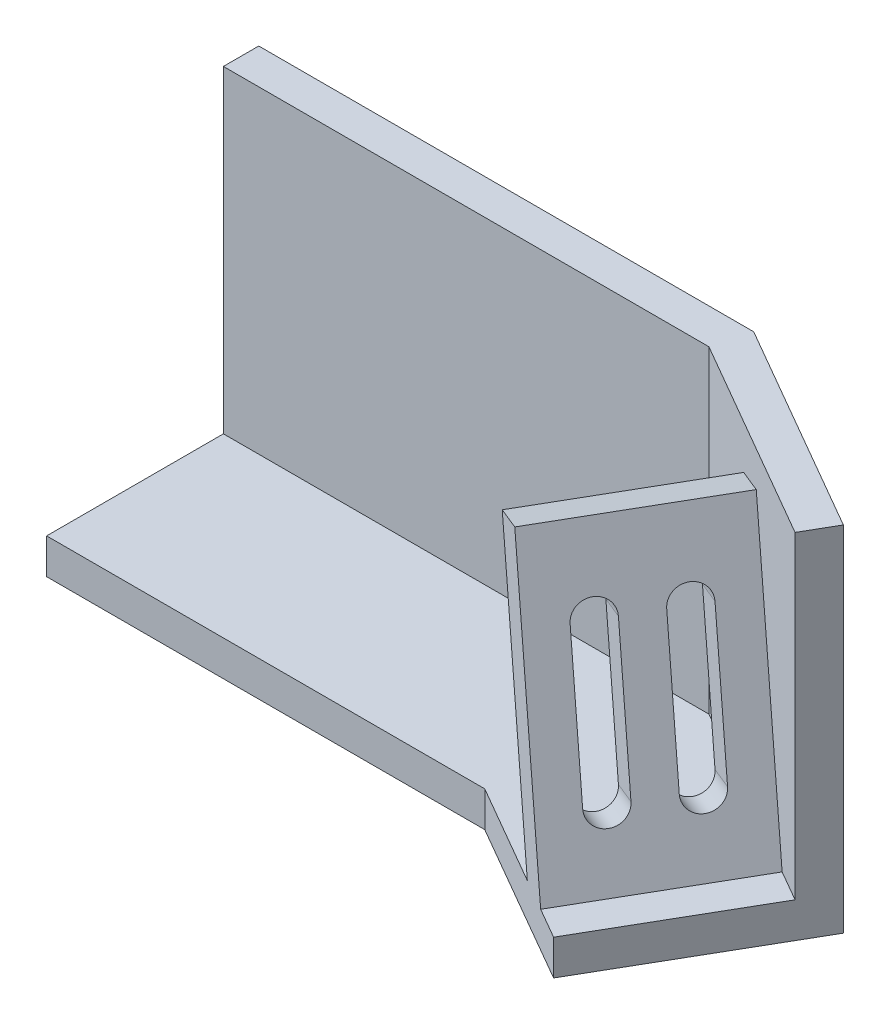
from build123d import *

# Parameters (mm, degrees)
EXTRUDE_1_DEPTH     = 50
SHELL_1_T           = -5
EXTRUDE_2_DEPTH     = 25
CUT_EXTRUDE_1_REACH = 92.712


with BuildPart() as part:
    # Sketch 1 → Extrude 1 (new body)
    with BuildSketch(Plane(origin=(0, 0, 0), x_dir=(1, 0, 0), z_dir=(0, 1, 0))):
        Polygon((0, 0), (70, 0), (100, -17.320508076), (85, -43.301270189), (61.961524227, -30), (0, -30), align=None)
    extrude(amount=EXTRUDE_1_DEPTH)

    # Shell 1
    shell_1_openings = [part.faces().sort_by_distance(p)[0] for p in [
        (47.758792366, 50, 17.024554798),
        (92.5, 25, 30.310889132),
        (73.480762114, 25, 36.650635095),
        (30.980762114, 25, 30),
        (0, 25, 15),
    ]]
    offset(amount=SHELL_1_T, openings=shell_1_openings, kind=Kind.INTERSECTION)

    # Sketch 2 → Extrude 2 (add)
    with BuildSketch(Plane(origin=(15, 0, -25.980762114), x_dir=(0.866025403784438, 0, 0.5000000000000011), z_dir=(-0.5000000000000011, 0, 0.8660254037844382))):
        Polygon((90.262794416, 5), (85.108912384, 5), (75.412081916, 43.787321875), (80.262794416, 45), align=None)
    extrude(amount=EXTRUDE_2_DEPTH)

    # Sketch 3 → Cut-Extrude 1 (cut, up to next)
    with BuildSketch(Plane(origin=(74.590498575, 21.532422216, 43.064844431), x_dir=(0.4660413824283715, 0.13453455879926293, -0.8744746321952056), z_dir=(0.8401680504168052, 0.24253562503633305, 0.4850712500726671)), mode=Mode.PRIVATE) as cut_extrude_1_sk1:
        with BuildLine():
            Line((16.652127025, 10.753435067), (13.878626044, -9.053323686))
            ThreePointArc((13.878626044, -9.053323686), (11.056093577, -11.182480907), (8.926936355, -8.359948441))
            Line((8.926936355, -8.359948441), (11.700437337, 11.446810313))
            ThreePointArc((11.700437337, 11.446810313), (14.522969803, 13.575967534), (16.652127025, 10.753435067))
        make_face()
    cut_extrude_1_tool1 = extrude(cut_extrude_1_sk1.sketch, amount=-CUT_EXTRUDE_1_REACH, mode=Mode.PRIVATE) & part.part
    # Sketch 3 → Cut-Extrude 1 (cut, up to next)
    with BuildSketch(Plane(origin=(74.590498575, 21.532422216, 43.064844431), x_dir=(0.4660413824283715, 0.13453455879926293, -0.8744746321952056), z_dir=(0.8401680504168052, 0.24253562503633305, 0.4850712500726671)), mode=Mode.PRIVATE) as cut_extrude_1_sk2:
        with BuildLine():
            Line((26.555506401, 9.366684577), (23.78200542, -10.440074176))
            ThreePointArc((23.78200542, -10.440074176), (20.959472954, -12.569231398), (18.830315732, -9.746698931))
            Line((18.830315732, -9.746698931), (21.603816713, 10.060059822))
            ThreePointArc((21.603816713, 10.060059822), (24.42634918, 12.189217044), (26.555506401, 9.366684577))
        make_face()
    cut_extrude_1_tool2 = extrude(cut_extrude_1_sk2.sketch, amount=-CUT_EXTRUDE_1_REACH, mode=Mode.PRIVATE) & part.part
    add(cut_extrude_1_tool1.solids().sort_by_distance((80.219033, 24.40285, 31.880723))[0], mode=Mode.SUBTRACT)
    add(cut_extrude_1_tool2.solids().sort_by_distance((85.219033, 24.40285, 23.220469))[0], mode=Mode.SUBTRACT)


solid = part.part
